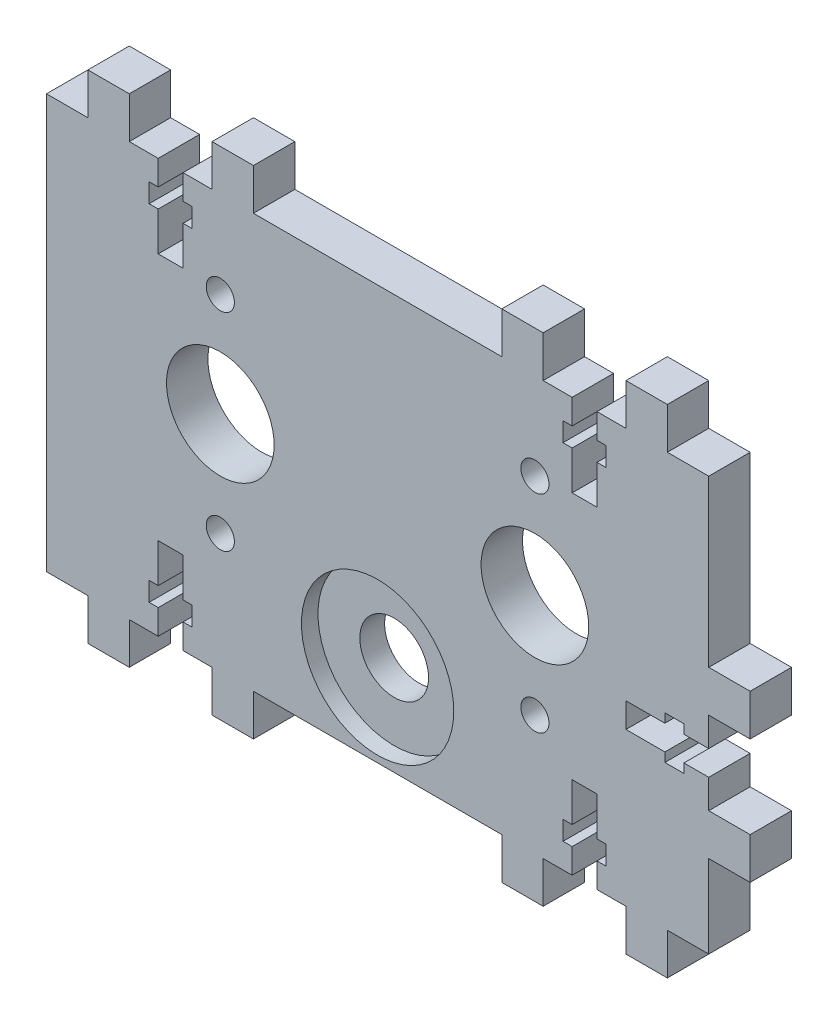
from build123d import *

# Parameters (mm, degrees)
ESQUISSE1_R             = 1.7
ESQUISSE1_R_2           = 6.5
ESQUISSE1_R_3           = 3.15
BOSS_EXTRU_1_DEPTH      = 5
ESQUISSE2_R             = 9.2
ENL_V_MAT_EXTRU_1_DEPTH = 2
ESQUISSE3_R             = 4.15
ENL_V_MAT_EXTRU_2_DEPTH = 102.286721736


with BuildPart() as part:
    # Esquisse1 → Boss.-Extru.1 (new body)
    with BuildSketch(Plane.XY):
        Polygon((5, 0), (0, 0), (0, 50), (5, 50), (5, 55), (10, 55), (10, 50), (13.5, 50), (13.5, 47), (12.4, 47), (12.4, 44.7), (13.5, 44.7), (13.5, 40), (16.5, 40), (16.5, 44.7), (17.6, 44.7), (17.6, 47), (16.5, 47), (16.5, 50), (20, 50), (20, 55), (25, 55), (25, 50), (55, 50), (55, 55), (60, 55), (60, 50), (63.5, 50), (63.5, 47), (62.4, 47), (62.4, 44.7), (63.5, 44.7), (63.5, 40), (66.5, 40), (66.5, 44.7), (67.6, 44.7), (67.6, 47), (66.5, 47), (66.5, 50), (70, 50), (70, 55), (75, 55), (75, 50), (80, 50), (80, 30), (85, 30), (85, 25), (80, 25), (80, 21.5), (77, 21.5), (77, 22.6), (74.7, 22.6), (74.7, 21.5), (70, 21.5), (70, 18.5), (74.7, 18.5), (74.7, 17.4), (77, 17.4), (77, 18.5), (80, 18.5), (80, 15), (85, 15), (85, 10), (80, 10), (80, 0), (75, 0), (75, -5), (70, -5), (70, 0), (66.5, 0), (66.5, 3), (67.6, 3), (67.6, 5.3), (66.5, 5.3), (66.5, 10), (63.5, 10), (63.5, 5.3), (62.4, 5.3), (62.4, 3), (63.5, 3), (63.5, 0), (60, 0), (60, -5), (55, -5), (55, 0), (25, 0), (25, -5), (20, -5), (20, 0), (16.5, 0), (16.5, 3), (17.6, 3), (17.6, 5.3), (16.5, 5.3), (16.5, 10), (13.5, 10), (13.5, 5.3), (12.4, 5.3), (12.4, 3), (13.5, 3), (13.5, 0), (10, 0), (10, -5), (5, -5), align=None)
        with Locations((21, 39.507351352)):
            Circle(ESQUISSE1_R, mode=Mode.SUBTRACT)
        with Locations((21, 14.507351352)):
            Circle(ESQUISSE1_R, mode=Mode.SUBTRACT)
        with Locations((21, 27.007351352)):
            Circle(ESQUISSE1_R_2, mode=Mode.SUBTRACT)
        with Locations((40, 10)):
            Circle(ESQUISSE1_R_3, mode=Mode.SUBTRACT)
        with Locations((59, 27.007351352)):
            Circle(ESQUISSE1_R_2, mode=Mode.SUBTRACT)
        with Locations((59, 14.507351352)):
            Circle(ESQUISSE1_R, mode=Mode.SUBTRACT)
        with Locations((59, 39.507351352)):
            Circle(ESQUISSE1_R, mode=Mode.SUBTRACT)
    extrude(amount=BOSS_EXTRU_1_DEPTH)

    # Esquisse2 → Enl_v. mat.-Extru.1 (cut)
    with BuildSketch(Plane.XY.offset(5)):
        with Locations((40, 10)):
            Circle(ESQUISSE2_R)
    extrude(amount=-ENL_V_MAT_EXTRU_1_DEPTH, mode=Mode.SUBTRACT)

    # Esquisse3 → Enl_v. mat.-Extru.2 (cut, through all)
    with BuildSketch(Plane.XY.offset(3)):
        with Locations((40, 10)):
            Circle(ESQUISSE3_R)
    extrude(amount=-ENL_V_MAT_EXTRU_2_DEPTH, mode=Mode.SUBTRACT)


solid = part.part
